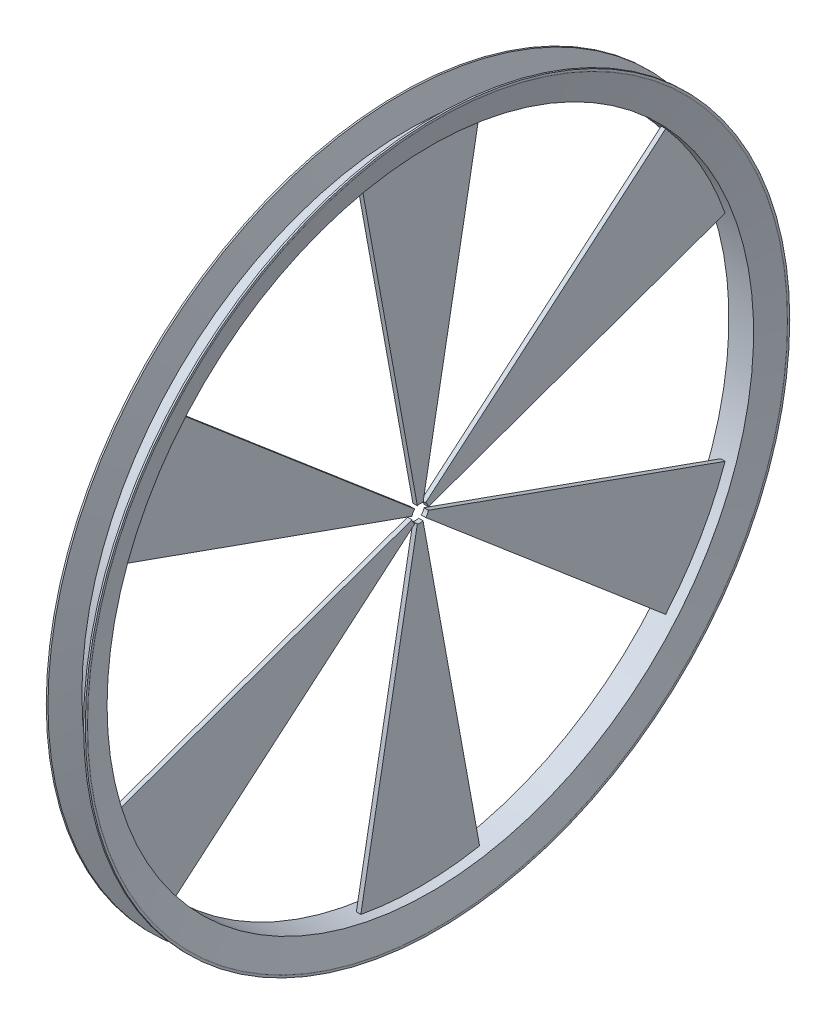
from build123d import *

# Parameters (mm, degrees)
ESTRUSIONE_ESTRUSIONE1_DEPTH = 2
RIPETIZIONECIRCOLARE1_COUNT  = 6


with BuildPart() as part:
    # Sketch1 → Revolve1 (revolve)
    with BuildSketch(Plane.XY, mode=Mode.PRIVATE) as revolve1_sk:
        with BuildLine():
            Line((-11.030041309, 0.5), (11.102592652, 0.5))
            Line((11.102592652, 0.5), (17.502201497, 24.383665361))
            ThreePointArc((17.502201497, 24.383665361), (17.527720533, 24.511958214), (17.536275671, 24.642484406))
            Line((17.536275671, 24.642484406), (17.536275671, 26.5))
            Line((17.536275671, 26.5), (15.998719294, 26.5))
            Line((15.998719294, 26.5), (9.567938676, 2.5))
            Line((9.567938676, 2.5), (-9.495387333, 2.5))
            Line((-9.495387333, 2.5), (-15.926167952, 26.5))
            Line((-15.926167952, 26.5), (-16.309831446, 26.5))
            Line((-16.309831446, 26.5), (-16.963724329, 26.5))
            Line((-16.963724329, 26.5), (-17.463724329, 26.5))
            Line((-17.463724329, 26.5), (-17.463724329, 24.642484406))
            Line((-17.463724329, 24.642484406), (-17.463724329, 24.510831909))
            Line((-17.463724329, 24.510831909), (-11.030041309, 0.5))
        make_face()
    revolve(revolve1_sk.sketch.rotate(Axis((-3.658509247, -289.525905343, 0), (1, 0, 0)), 90), axis=Axis((-3.658509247, -289.525905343, 0), (1, 0, 0)))

    # Schizzo1 → Estrusione-Estrusione1 (add, symmetric)
    with BuildSketch(Plane(origin=(0, 0, 0), x_dir=(0, 0, -1), z_dir=(1, 0, 0))):
        with BuildLine():
            Line((53.286076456, -4.437112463), (2.538498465, -282.468566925))
            ThreePointArc((2.538498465, -282.468566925), (0, -282.025905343), (-2.538498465, -282.468566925))
            Line((-2.538498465, -282.468566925), (-53.286076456, -4.437112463))
            ThreePointArc((-53.286076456, -4.437112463), (0, 0.5), (53.286076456, -4.437112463))
        make_face()
    estrusione_estrusione1 = extrude(amount=ESTRUSIONE_ESTRUSIONE1_DEPTH, both=True)

    # RipetizioneCircolare1: Estrusione-Estrusione1 ×6 about axis
    ripetizionecircolare1_axis = Axis((0, -289.525905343, 0), (1, 0, 0))
    for i in range(1, RIPETIZIONECIRCOLARE1_COUNT):
        add(estrusione_estrusione1.rotate(ripetizionecircolare1_axis, i * 360 / RIPETIZIONECIRCOLARE1_COUNT))


solid = part.part
